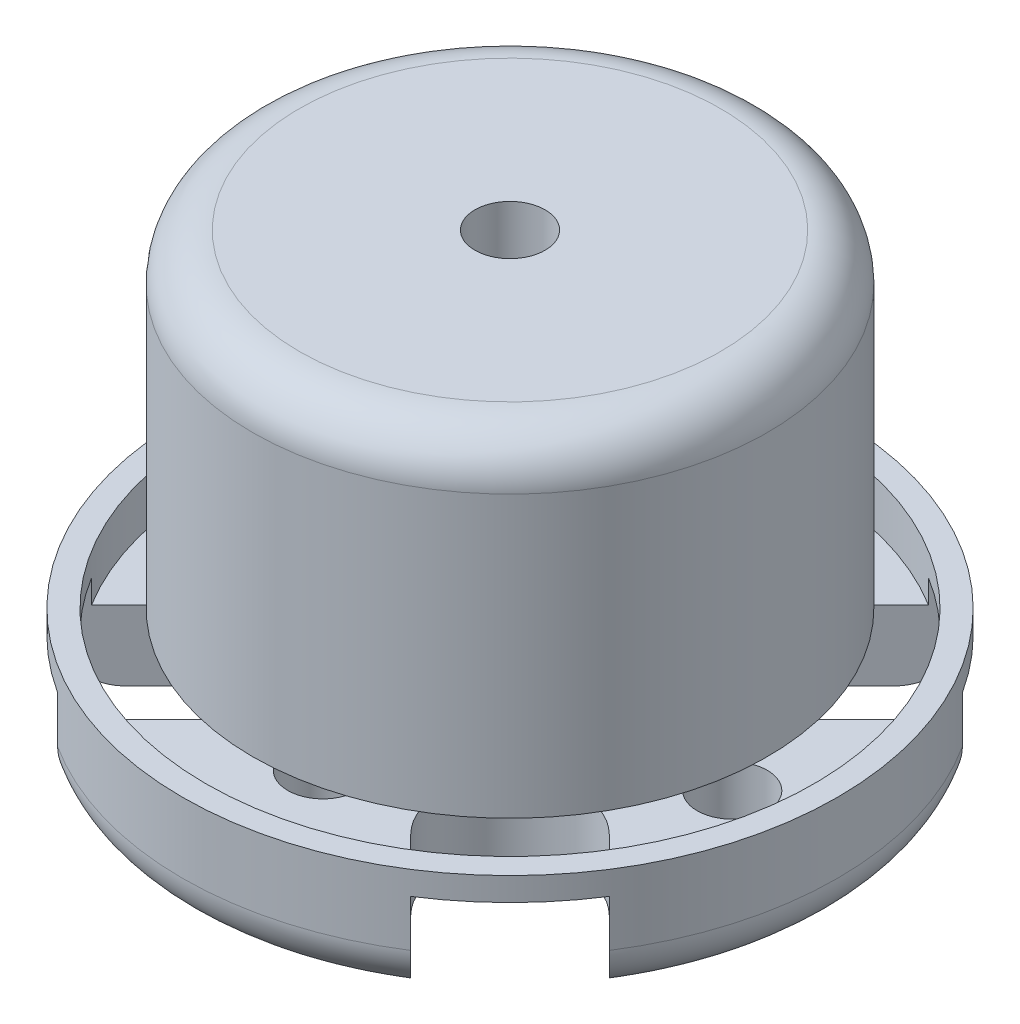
from build123d import *

# Parameters (mm, degrees)
SKETCH_1_R          = 14
SKETCH_1_R_2        = 1.5
EXTRUDE_1_DEPTH     = 5
SKETCH_2_R          = 13
SKETCH_2_R_2        = 4.5
CUT_EXTRUDE_1_DEPTH = 2
SKETCH_3_R          = 1.5
CUT_EXTRUDE_2_DEPTH = 21.420577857
SKETCH_4_R          = 4
CUT_EXTRUDE_3_DEPTH = 3
CUT_EXTRUDE_4_DEPTH = 4
FILLET_1_R          = 2
EXTRUDE_START       = 14
SKETCH_6_R          = 11
SKETCH_6_R_2        = 1.5
EXTRUDE_3_DEPTH     = 14
FILLET_2_R          = 2


with BuildPart() as part:
    # Sketch 1 → Extrude 1 (new body)
    with BuildSketch(Plane(origin=(0, 0, 0), x_dir=(1, 0, 0), z_dir=(0, 1, 0))):
        with Locations(Location((0, 0, 0), (0, 0, 270))):
            Circle(SKETCH_1_R)
        with Locations(Location((-9.5, 0, 0), (0, 0, 270))):
            Circle(SKETCH_1_R_2, mode=Mode.SUBTRACT)
        with Locations(Location((9.5, 0, 0), (0, 0, 270))):
            Circle(SKETCH_1_R_2, mode=Mode.SUBTRACT)
        with Locations(Location((0, 8, 0), (0, 0, 270))):
            Circle(SKETCH_1_R_2, mode=Mode.SUBTRACT)
        with Locations(Location((0, -8, 0), (0, 0, 270))):
            Circle(SKETCH_1_R_2, mode=Mode.SUBTRACT)
    extrude(amount=EXTRUDE_1_DEPTH)

    # Sketch 2 → Cut-Extrude 1 (cut)
    with BuildSketch(Plane(origin=(0, 5, 0), x_dir=(1, 0, 0), z_dir=(0, 1, 0))):
        with Locations(Location((0, 0, 0), (0, 0, 270))):
            Circle(SKETCH_2_R)
        with Locations(Location((0, 0, 0), (0, 0, 270))):
            Circle(SKETCH_2_R_2, mode=Mode.SUBTRACT)
    extrude(amount=-CUT_EXTRUDE_1_DEPTH, mode=Mode.SUBTRACT)

    # Sketch 3 → Cut-Extrude 2 (cut, through all)
    with BuildSketch(Plane(origin=(0, 5, 0), x_dir=(1, 0, 0), z_dir=(0, 1, 0))):
        with Locations(Location((0, 0, 0), (0, 0, 270))):
            Circle(SKETCH_3_R)
    extrude(amount=-CUT_EXTRUDE_2_DEPTH, mode=Mode.SUBTRACT)

    # Sketch 4 → Cut-Extrude 3 (cut)
    with BuildSketch(Plane.XZ):
        with Locations(Location((0, 0, 0), (0, 0, 270))):
            Circle(SKETCH_4_R)
    extrude(amount=-CUT_EXTRUDE_3_DEPTH, mode=Mode.SUBTRACT)

    # Sketch 5 → Cut-Extrude 4 (cut)
    with BuildSketch(Plane.XZ):
        with BuildLine():
            Line((8.485281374, 4.242640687), (11.790860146, 7.548219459))
            ThreePointArc((11.790860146, 7.548219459), (9.899494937, 9.899494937), (7.548219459, 11.790860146))
            Line((7.548219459, 11.790860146), (4.242640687, 8.485281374))
            ThreePointArc((4.242640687, 8.485281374), (4.242640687, 4.242640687), (8.485281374, 4.242640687))
        make_face()
        with BuildLine():
            Line((8.485281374, -4.242640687), (11.790860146, -7.548219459))
            ThreePointArc((11.790860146, -7.548219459), (9.899494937, -9.899494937), (7.548219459, -11.790860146))
            Line((7.548219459, -11.790860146), (4.242640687, -8.485281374))
            ThreePointArc((4.242640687, -8.485281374), (4.242640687, -4.242640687), (8.485281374, -4.242640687))
        make_face()
        with BuildLine():
            Line((-4.242640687, -8.485281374), (-7.548219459, -11.790860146))
            ThreePointArc((-7.548219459, -11.790860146), (-9.899494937, -9.899494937), (-11.790860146, -7.548219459))
            Line((-11.790860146, -7.548219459), (-8.485281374, -4.242640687))
            ThreePointArc((-8.485281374, -4.242640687), (-4.242640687, -4.242640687), (-4.242640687, -8.485281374))
        make_face()
        with BuildLine():
            Line((-8.485281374, 4.242640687), (-11.790860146, 7.548219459))
            ThreePointArc((-11.790860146, 7.548219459), (-9.899494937, 9.899494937), (-7.548219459, 11.790860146))
            Line((-7.548219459, 11.790860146), (-4.242640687, 8.485281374))
            ThreePointArc((-4.242640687, 8.485281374), (-4.242640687, 4.242640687), (-8.485281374, 4.242640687))
        make_face()
    extrude(amount=-CUT_EXTRUDE_4_DEPTH, mode=Mode.SUBTRACT)

    # Fillet 1
    fillet_1_edges = [part.edges().sort_by_distance(p)[0] for p in [
        (3.932426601, 0, 13.436369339),
        (14, 0, 0),
        (0, 0, -14),
        (-14, 0, 0),
    ]]
    fillet(fillet_1_edges, radius=FILLET_1_R)

    # Sketch 6 → Extrude 3 (add)
    with BuildSketch(Plane(origin=(0, 5, 0), x_dir=(1, 0, 0), z_dir=(0, 1, 0)).offset(EXTRUDE_START)):
        with Locations(Location((0, 0, 0), (0, 0, 270))):
            Circle(SKETCH_6_R)
        with Locations(Location((0, 0, 0), (0, 0, 270))):
            Circle(SKETCH_6_R_2, mode=Mode.SUBTRACT)
    extrude(amount=-EXTRUDE_3_DEPTH)

    # Fillet 2
    fillet_2_edges = [part.edges().sort_by_distance(p)[0] for p in [
        (0, 19, -11),
    ]]
    fillet(fillet_2_edges, radius=FILLET_2_R)


solid = part.part
